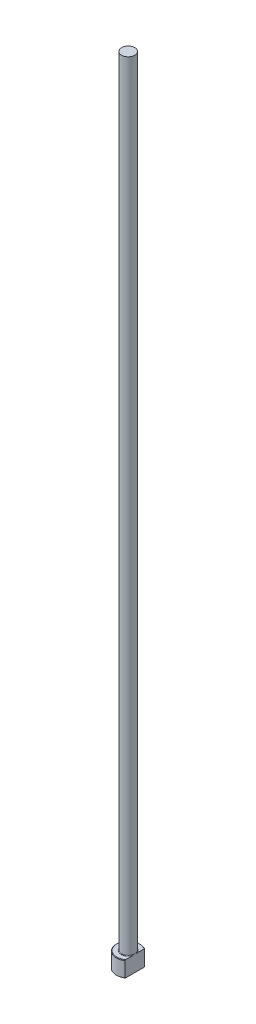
ISO-10303-21;
HEADER;
FILE_DESCRIPTION(('STEP AP214'),'2;1');
FILE_NAME('part.step','',(''),(''),'','','');
FILE_SCHEMA(('AUTOMOTIVE_DESIGN { 1 0 10303 214 1 1 1 1 }'));
ENDSEC;
DATA;
#1=APPLICATION_CONTEXT('core data for automotive mechanical design processes');
#2=APPLICATION_PROTOCOL_DEFINITION('international standard','automotive_design',2000,#1);
#3=PRODUCT_CONTEXT('',#1,'mechanical');
#4=PRODUCT('Part','Part','',(#3));
#5=PRODUCT_RELATED_PRODUCT_CATEGORY('part','',(#4));
#6=PRODUCT_DEFINITION_FORMATION('','',#4);
#7=PRODUCT_DEFINITION_CONTEXT('part definition',#1,'design');
#8=PRODUCT_DEFINITION('design','',#6,#7);
#9=PRODUCT_DEFINITION_SHAPE('','',#8);
#10=(LENGTH_UNIT() NAMED_UNIT(*) SI_UNIT(.MILLI.,.METRE.));
#11=(NAMED_UNIT(*) PLANE_ANGLE_UNIT() SI_UNIT($,.RADIAN.));
#12=(NAMED_UNIT(*) SI_UNIT($,.STERADIAN.) SOLID_ANGLE_UNIT());
#13=UNCERTAINTY_MEASURE_WITH_UNIT(LENGTH_MEASURE(1.E-05),#10,'distance_accuracy_value','');
#14=(GEOMETRIC_REPRESENTATION_CONTEXT(3) GLOBAL_UNCERTAINTY_ASSIGNED_CONTEXT((#13)) GLOBAL_UNIT_ASSIGNED_CONTEXT((#10,
#11,#12)) REPRESENTATION_CONTEXT('',''));
#15=CARTESIAN_POINT('',(0.,0.,0.));
#16=DIRECTION('',(0.,0.,1.));
#17=DIRECTION('',(1.,0.,0.));
#18=AXIS2_PLACEMENT_3D('',#15,#16,#17);
#19=CARTESIAN_POINT('',(0.,0.,0.));
#20=DIRECTION('',(0.,-1.,0.));
#21=DIRECTION('',(0.,0.,-1.));
#22=AXIS2_PLACEMENT_3D('',#19,#20,#21);
#23=PLANE('',#22);
#24=CARTESIAN_POINT('',(0.,0.,0.));
#25=DIRECTION('',(0.,-1.,0.));
#26=DIRECTION('',(0.,0.,-1.));
#27=AXIS2_PLACEMENT_3D('',#24,#25,#26);
#28=CIRCLE('',#27,4.29999999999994);
#29=CARTESIAN_POINT('',(2.49999999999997,0.,3.49857113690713));
#30=VERTEX_POINT('',#29);
#31=CARTESIAN_POINT('',(2.49999999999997,0.,-3.49857113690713));
#32=VERTEX_POINT('',#31);
#33=EDGE_CURVE('E98',#30,#32,#28,.T.);
#34=ORIENTED_EDGE('',*,*,#33,.T.);
#35=DIRECTION('',(0.,0.,1.));
#36=VECTOR('',#35,1.);
#37=CARTESIAN_POINT('',(2.49999999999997,0.,3.74165738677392));
#38=LINE('',#37,#36);
#39=EDGE_CURVE('E83',#32,#30,#38,.T.);
#40=ORIENTED_EDGE('',*,*,#39,.T.);
#41=EDGE_LOOP('',(#34,#40));
#42=FACE_BOUND('',#41,.T.);
#43=ADVANCED_FACE('F32',(#42),#23,.T.);
#44=CARTESIAN_POINT('',(0.,259.958771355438,0.));
#45=DIRECTION('',(0.,1.,0.));
#46=DIRECTION('',(0.,0.,1.));
#47=AXIS2_PLACEMENT_3D('',#44,#45,#46);
#48=CYLINDRICAL_SURFACE('',#47,4.49999999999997);
#49=CARTESIAN_POINT('',(0.,5.80000000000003,0.));
#50=DIRECTION('',(0.,1.,0.));
#51=DIRECTION('',(0.,0.,1.));
#52=AXIS2_PLACEMENT_3D('',#49,#50,#51);
#53=CIRCLE('',#52,4.49999999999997);
#54=CARTESIAN_POINT('',(2.49999999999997,5.80000000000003,3.74165738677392));
#55=VERTEX_POINT('',#54);
#56=CARTESIAN_POINT('',(2.49999999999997,5.80000000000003,-3.74165738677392));
#57=VERTEX_POINT('',#56);
#58=EDGE_CURVE('E104',#55,#57,#53,.F.);
#59=ORIENTED_EDGE('',*,*,#58,.T.);
#60=DIRECTION('',(0.,-1.,0.));
#61=VECTOR('',#60,1.);
#62=CARTESIAN_POINT('',(2.49999999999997,300.,-3.74165738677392));
#63=LINE('',#62,#61);
#64=CARTESIAN_POINT('',(2.49999999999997,0.200000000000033,-3.74165738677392));
#65=VERTEX_POINT('',#64);
#66=EDGE_CURVE('E183',#57,#65,#63,.T.);
#67=ORIENTED_EDGE('',*,*,#66,.T.);
#68=CARTESIAN_POINT('',(0.,0.200000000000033,0.));
#69=DIRECTION('',(0.,-1.,0.));
#70=DIRECTION('',(0.,0.,-1.));
#71=AXIS2_PLACEMENT_3D('',#68,#69,#70);
#72=CIRCLE('',#71,4.49999999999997);
#73=CARTESIAN_POINT('',(2.49999999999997,0.200000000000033,3.74165738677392));
#74=VERTEX_POINT('',#73);
#75=EDGE_CURVE('E100',#65,#74,#72,.F.);
#76=ORIENTED_EDGE('',*,*,#75,.T.);
#77=DIRECTION('',(0.,-1.,0.));
#78=VECTOR('',#77,1.);
#79=CARTESIAN_POINT('',(2.49999999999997,300.,3.74165738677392));
#80=LINE('',#79,#78);
#81=EDGE_CURVE('E93',#55,#74,#80,.T.);
#82=ORIENTED_EDGE('',*,*,#81,.F.);
#83=EDGE_LOOP('',(#59,#67,#76,#82));
#84=FACE_BOUND('',#83,.T.);
#85=ADVANCED_FACE('F158',(#84),#48,.T.);
#86=CARTESIAN_POINT('',(-4.49999999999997,6.,0.));
#87=DIRECTION('',(0.,1.,0.));
#88=DIRECTION('',(0.,0.,1.));
#89=AXIS2_PLACEMENT_3D('',#86,#87,#88);
#90=PLANE('',#89);
#91=CARTESIAN_POINT('',(0.,6.,0.));
#92=DIRECTION('',(0.,1.,0.));
#93=DIRECTION('',(0.,0.,1.));
#94=AXIS2_PLACEMENT_3D('',#91,#92,#93);
#95=CIRCLE('',#94,4.29999999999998);
#96=CARTESIAN_POINT('',(2.49999999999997,6.,-3.49857113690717));
#97=VERTEX_POINT('',#96);
#98=CARTESIAN_POINT('',(2.49999999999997,6.,3.49857113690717));
#99=VERTEX_POINT('',#98);
#100=EDGE_CURVE('E178',#97,#99,#95,.T.);
#101=ORIENTED_EDGE('',*,*,#100,.T.);
#102=DIRECTION('',(0.,0.,-1.));
#103=VECTOR('',#102,1.);
#104=CARTESIAN_POINT('',(2.49999999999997,6.,0.));
#105=LINE('',#104,#103);
#106=CARTESIAN_POINT('',(2.49999999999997,5.99999999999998,1.01980390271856));
#107=VERTEX_POINT('',#106);
#108=EDGE_CURVE('E57',#99,#107,#105,.T.);
#109=ORIENTED_EDGE('',*,*,#108,.T.);
#110=CARTESIAN_POINT('',(0.,6.,0.));
#111=DIRECTION('',(0.,1.,0.));
#112=DIRECTION('',(0.,0.,1.));
#113=AXIS2_PLACEMENT_3D('',#110,#111,#112);
#114=CIRCLE('',#113,2.69999999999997);
#115=CARTESIAN_POINT('',(2.49999999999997,5.99999999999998,-1.01980390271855));
#116=VERTEX_POINT('',#115);
#117=EDGE_CURVE('E107',#107,#116,#114,.F.);
#118=ORIENTED_EDGE('',*,*,#117,.T.);
#119=EDGE_CURVE('E136',#116,#97,#105,.T.);
#120=ORIENTED_EDGE('',*,*,#119,.T.);
#121=EDGE_LOOP('',(#101,#109,#118,#120));
#122=FACE_BOUND('',#121,.T.);
#123=ADVANCED_FACE('F147',(#122),#90,.T.);
#124=CARTESIAN_POINT('',(0.,6.00000000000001,0.));
#125=DIRECTION('',(0.,-1.,0.));
#126=DIRECTION('',(0.,0.,-1.));
#127=AXIS2_PLACEMENT_3D('',#124,#125,#126);
#128=CONICAL_SURFACE('',#127,4.29999999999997,0.785398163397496);
#129=ORIENTED_EDGE('',*,*,#58,.F.);
#130=CARTESIAN_POINT('',(2.49999999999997,1.69536803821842,8.233449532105));
#131=CARTESIAN_POINT('',(2.49999999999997,1.84159559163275,8.08062583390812));
#132=CARTESIAN_POINT('',(2.49999999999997,1.98764793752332,7.92763429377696));
#133=CARTESIAN_POINT('',(2.49999999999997,2.27932845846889,7.62124541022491));
#134=CARTESIAN_POINT('',(2.49999999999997,2.42495663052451,7.46784806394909));
#135=CARTESIAN_POINT('',(2.49999999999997,2.86116481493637,7.0068675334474));
#136=CARTESIAN_POINT('',(2.49999999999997,3.15099433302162,6.69857321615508));
#137=CARTESIAN_POINT('',(2.49999999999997,3.72884985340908,6.07807253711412));
#138=CARTESIAN_POINT('',(2.49999999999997,4.01686464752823,5.76585569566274));
#139=CARTESIAN_POINT('',(2.49999999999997,4.44539957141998,5.29439081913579));
#140=CARTESIAN_POINT('',(2.49999999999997,4.58765535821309,5.1367216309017));
#141=CARTESIAN_POINT('',(2.49999999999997,4.87066186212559,4.8200396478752));
#142=CARTESIAN_POINT('',(2.49999999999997,5.011412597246,4.66102686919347));
#143=CARTESIAN_POINT('',(2.49999999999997,5.29570787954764,4.33582683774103));
#144=CARTESIAN_POINT('',(2.49999999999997,5.43918418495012,4.16957975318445));
#145=CARTESIAN_POINT('',(2.49999999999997,5.72327592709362,3.83461659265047));
#146=CARTESIAN_POINT('',(2.49999999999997,5.86389099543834,3.66590020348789));
#147=CARTESIAN_POINT('',(2.49999999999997,6.14107420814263,3.32513857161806));
#148=CARTESIAN_POINT('',(2.49999999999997,6.27764223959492,3.15309323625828));
#149=CARTESIAN_POINT('',(2.49999999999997,6.47795110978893,2.89156777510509));
#150=CARTESIAN_POINT('',(2.49999999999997,6.54395767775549,2.80382460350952));
#151=CARTESIAN_POINT('',(2.49999999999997,6.67408242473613,2.62695176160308));
#152=CARTESIAN_POINT('',(2.49999999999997,6.73820069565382,2.5378221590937));
#153=CARTESIAN_POINT('',(2.49999999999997,6.87152528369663,2.34725612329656));
#154=CARTESIAN_POINT('',(2.49999999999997,6.94043579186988,2.24561149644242));
#155=CARTESIAN_POINT('',(2.49999999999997,7.07436956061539,2.0398042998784));
#156=CARTESIAN_POINT('',(2.49999999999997,7.13939350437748,1.93564217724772));
#157=CARTESIAN_POINT('',(2.49999999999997,7.26425850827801,1.72423874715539));
#158=CARTESIAN_POINT('',(2.49999999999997,7.32410048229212,1.61699798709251));
#159=CARTESIAN_POINT('',(2.49999999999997,7.43673687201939,1.39892979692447));
#160=CARTESIAN_POINT('',(2.49999999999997,7.48953435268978,1.28810395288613));
#161=CARTESIAN_POINT('',(2.49999999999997,7.60157711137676,1.02468144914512));
#162=CARTESIAN_POINT('',(2.49999999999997,7.65714985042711,0.870425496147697));
#163=CARTESIAN_POINT('',(2.49999999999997,7.72191807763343,0.634205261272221));
#164=CARTESIAN_POINT('',(2.49999999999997,7.74039604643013,0.554773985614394));
#165=CARTESIAN_POINT('',(2.49999999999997,7.77027635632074,0.394570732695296));
#166=CARTESIAN_POINT('',(2.49999999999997,7.78167951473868,0.313798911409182));
#167=CARTESIAN_POINT('',(2.49999999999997,7.79679993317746,0.150603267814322));
#168=CARTESIAN_POINT('',(2.49999999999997,7.80042867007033,0.0681710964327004));
#169=CARTESIAN_POINT('',(2.49999999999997,7.79949026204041,-0.0966436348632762));
#170=CARTESIAN_POINT('',(2.49999999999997,7.79492331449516,-0.179026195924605));
#171=CARTESIAN_POINT('',(2.49999999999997,7.77788997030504,-0.343090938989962));
#172=CARTESIAN_POINT('',(2.49999999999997,7.76541077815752,-0.424771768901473));
#173=CARTESIAN_POINT('',(2.49999999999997,7.73330588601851,-0.586708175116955));
#174=CARTESIAN_POINT('',(2.49999999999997,7.71367845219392,-0.666963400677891));
#175=CARTESIAN_POINT('',(2.49999999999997,7.65833470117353,-0.860438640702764));
#176=CARTESIAN_POINT('',(2.49999999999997,7.61933642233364,-0.972715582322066));
#177=CARTESIAN_POINT('',(2.49999999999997,7.53162689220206,-1.19338710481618));
#178=CARTESIAN_POINT('',(2.49999999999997,7.48290892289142,-1.30177893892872));
#179=CARTESIAN_POINT('',(2.49999999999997,7.37798916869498,-1.51554087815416));
#180=CARTESIAN_POINT('',(2.49999999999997,7.32174953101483,-1.62089218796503));
#181=CARTESIAN_POINT('',(2.49999999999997,7.23334776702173,-1.77656150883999));
#182=CARTESIAN_POINT('',(2.49999999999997,7.20321149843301,-1.82805098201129));
#183=CARTESIAN_POINT('',(2.49999999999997,7.14176188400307,-1.93032073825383));
#184=CARTESIAN_POINT('',(2.49999999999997,7.11044858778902,-1.98110105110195));
#185=CARTESIAN_POINT('',(2.49999999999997,7.0042870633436,-2.14944611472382));
#186=CARTESIAN_POINT('',(2.49999999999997,6.92717470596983,-2.26558431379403));
#187=CARTESIAN_POINT('',(2.49999999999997,6.76891329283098,-2.49508800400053));
#188=CARTESIAN_POINT('',(2.49999999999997,6.68776326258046,-2.60845281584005));
#189=CARTESIAN_POINT('',(2.49999999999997,6.52238824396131,-2.83304153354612));
#190=CARTESIAN_POINT('',(2.49999999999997,6.43816097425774,-2.94426375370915));
#191=CARTESIAN_POINT('',(2.49999999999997,6.26739791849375,-3.16492607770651));
#192=CARTESIAN_POINT('',(2.49999999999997,6.18086198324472,-3.27436606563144));
#193=CARTESIAN_POINT('',(2.49999999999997,6.00577178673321,-3.49207549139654));
#194=CARTESIAN_POINT('',(2.49999999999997,5.91721294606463,-3.60034123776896));
#195=CARTESIAN_POINT('',(2.49999999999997,5.73865921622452,-3.81568349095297));
#196=CARTESIAN_POINT('',(2.49999999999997,5.64866429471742,-3.92275997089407));
#197=CARTESIAN_POINT('',(2.49999999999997,5.37704561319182,-4.24242567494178));
#198=CARTESIAN_POINT('',(2.49999999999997,5.19370393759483,-4.45355444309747));
#199=CARTESIAN_POINT('',(2.49999999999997,4.82367634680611,-4.87338717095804));
#200=CARTESIAN_POINT('',(2.49999999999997,4.63698598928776,-5.08208719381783));
#201=CARTESIAN_POINT('',(2.49999999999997,4.26138721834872,-5.49751911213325));
#202=CARTESIAN_POINT('',(2.49999999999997,4.07247857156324,-5.70425079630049));
#203=CARTESIAN_POINT('',(2.49999999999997,3.69329624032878,-6.11595801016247));
#204=CARTESIAN_POINT('',(2.49999999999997,3.50302465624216,-6.32093547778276));
#205=CARTESIAN_POINT('',(2.49999999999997,3.12126439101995,-6.72975403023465));
#206=CARTESIAN_POINT('',(2.49999999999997,2.92977570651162,-6.93359511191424));
#207=CARTESIAN_POINT('',(2.49999999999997,2.65119470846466,-7.2287714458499));
#208=CARTESIAN_POINT('',(2.49999999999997,2.56447790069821,-7.32046158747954));
#209=CARTESIAN_POINT('',(2.49999999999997,2.39085496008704,-7.50369470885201));
#210=CARTESIAN_POINT('',(2.49999999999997,2.30394879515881,-7.59523765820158));
#211=CARTESIAN_POINT('',(2.49999999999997,2.13016920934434,-7.77797738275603));
#212=CARTESIAN_POINT('',(2.49999999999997,2.04329612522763,-7.86917447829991));
#213=CARTESIAN_POINT('',(2.49999999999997,1.86942568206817,-8.0514176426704));
#214=CARTESIAN_POINT('',(2.49999999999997,1.78242834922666,-8.14246373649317));
#215=CARTESIAN_POINT('',(2.49999999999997,1.69536803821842,-8.233449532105));
#216=B_SPLINE_CURVE_WITH_KNOTS('',3,(#130,#131,#132,#133,#134,#135,#136,#137,#138,#139,#140,
#141,#142,#143,#144,#145,#146,#147,#148,#149,#150,#151,#152,#153,#154,#155,#156,#157,#158,#159,
#160,#161,#162,#163,#164,#165,#166,#167,#168,#169,#170,#171,#172,#173,#174,#175,#176,#177,#178,
#179,#180,#181,#182,#183,#184,#185,#186,#187,#188,#189,#190,#191,#192,#193,#194,#195,#196,#197,
#198,#199,#200,#201,#202,#203,#204,#205,#206,#207,#208,#209,#210,#211,#212,#213,#214,#215),
.UNSPECIFIED.,.F.,.F.,(4,2,2,2,2,2,2,2,2,2,2,2,2,2,2,2,2,2,2,2,2,2,2,2,2,2,2,2,2,2,2,2,2,2,2,2,
2,2,2,2,2,2,4),(0.,0.63453779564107,1.26908006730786,2.53848610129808,3.81276948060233,
4.44983884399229,5.08690057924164,5.74567154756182,6.40452680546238,7.06340042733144,
7.39277668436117,7.72213688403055,8.09047335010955,8.4587448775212,8.82695132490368,
9.19499704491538,9.68515232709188,9.92954493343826,10.1739093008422,10.4210416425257,
10.6681680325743,10.9156950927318,11.163282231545,11.5192140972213,11.8753928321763,
12.2334366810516,12.4124062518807,12.591368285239,13.0094573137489,13.427647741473,
13.8461547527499,14.2646888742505,14.6842890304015,15.1038986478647,15.9427186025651,
16.7827484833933,17.6228675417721,18.4618914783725,19.300917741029,19.6795229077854,
20.0581981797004,20.4360532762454,20.8138378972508),.UNSPECIFIED.);
#217=EDGE_CURVE('E135',#55,#99,#216,.T.);
#218=ORIENTED_EDGE('',*,*,#217,.T.);
#219=ORIENTED_EDGE('',*,*,#100,.F.);
#220=EDGE_CURVE('E127',#97,#57,#216,.T.);
#221=ORIENTED_EDGE('',*,*,#220,.T.);
#222=EDGE_LOOP('',(#129,#218,#219,#221));
#223=FACE_BOUND('',#222,.T.);
#224=ADVANCED_FACE('F143',(#223),#128,.T.);
#225=CARTESIAN_POINT('',(0.,0.200000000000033,0.));
#226=DIRECTION('',(0.,1.,0.));
#227=DIRECTION('',(0.,0.,1.));
#228=AXIS2_PLACEMENT_3D('',#225,#226,#227);
#229=CONICAL_SURFACE('',#228,4.49999999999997,0.785398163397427);
#230=ORIENTED_EDGE('',*,*,#75,.F.);
#231=CARTESIAN_POINT('',(2.49999999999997,4.30463196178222,-8.233449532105));
#232=CARTESIAN_POINT('',(2.49999999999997,4.15840440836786,-8.08062583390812));
#233=CARTESIAN_POINT('',(2.49999999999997,4.01235206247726,-7.92763429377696));
#234=CARTESIAN_POINT('',(2.49999999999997,3.72067154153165,-7.6212454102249));
#235=CARTESIAN_POINT('',(2.49999999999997,3.57504336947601,-7.46784806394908));
#236=CARTESIAN_POINT('',(2.49999999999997,3.13883518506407,-7.00686753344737));
#237=CARTESIAN_POINT('',(2.49999999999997,2.84900566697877,-6.69857321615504));
#238=CARTESIAN_POINT('',(2.49999999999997,2.27115014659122,-6.07807253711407));
#239=CARTESIAN_POINT('',(2.49999999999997,1.98313535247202,-5.76585569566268));
#240=CARTESIAN_POINT('',(2.49999999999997,1.55460042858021,-5.29439081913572));
#241=CARTESIAN_POINT('',(2.49999999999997,1.41234464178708,-5.13672163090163));
#242=CARTESIAN_POINT('',(2.49999999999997,1.12933813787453,-4.82003964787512));
#243=CARTESIAN_POINT('',(2.49999999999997,0.988587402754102,-4.66102686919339));
#244=CARTESIAN_POINT('',(2.49999999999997,0.70429212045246,-4.335826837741));
#245=CARTESIAN_POINT('',(2.49999999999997,0.560815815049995,-4.16957975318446));
#246=CARTESIAN_POINT('',(2.49999999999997,0.276724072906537,-3.83461659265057));
#247=CARTESIAN_POINT('',(2.49999999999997,0.136109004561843,-3.66590020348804));
#248=CARTESIAN_POINT('',(2.49999999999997,-0.141074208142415,-3.32513857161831));
#249=CARTESIAN_POINT('',(2.49999999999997,-0.277642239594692,-3.15309323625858));
#250=CARTESIAN_POINT('',(2.49999999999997,-0.47795110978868,-2.89156777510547));
#251=CARTESIAN_POINT('',(2.49999999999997,-0.543957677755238,-2.80382460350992));
#252=CARTESIAN_POINT('',(2.49999999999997,-0.674082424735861,-2.62695176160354));
#253=CARTESIAN_POINT('',(2.49999999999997,-0.73820069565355,-2.53782215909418));
#254=CARTESIAN_POINT('',(2.49999999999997,-0.871525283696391,-2.34725612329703));
#255=CARTESIAN_POINT('',(2.49999999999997,-0.94043579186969,-2.24561149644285));
#256=CARTESIAN_POINT('',(2.49999999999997,-1.07436956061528,-2.03980429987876));
#257=CARTESIAN_POINT('',(2.49999999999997,-1.13939350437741,-1.93564217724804));
#258=CARTESIAN_POINT('',(2.49999999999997,-1.26425850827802,-1.72423874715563));
#259=CARTESIAN_POINT('',(2.49999999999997,-1.32410048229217,-1.61699798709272));
#260=CARTESIAN_POINT('',(2.49999999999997,-1.4367368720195,-1.39892979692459));
#261=CARTESIAN_POINT('',(2.49999999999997,-1.48953435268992,-1.28810395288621));
#262=CARTESIAN_POINT('',(2.49999999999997,-1.60157711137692,-1.02468144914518));
#263=CARTESIAN_POINT('',(2.49999999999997,-1.65714985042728,-0.870425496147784));
#264=CARTESIAN_POINT('',(2.49999999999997,-1.72191807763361,-0.634205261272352));
#265=CARTESIAN_POINT('',(2.49999999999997,-1.74039604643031,-0.554773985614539));
#266=CARTESIAN_POINT('',(2.49999999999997,-1.77027635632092,-0.39457073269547));
#267=CARTESIAN_POINT('',(2.49999999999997,-1.78167951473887,-0.313798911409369));
#268=CARTESIAN_POINT('',(2.49999999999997,-1.79679993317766,-0.150603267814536));
#269=CARTESIAN_POINT('',(2.49999999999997,-1.80042867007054,-0.0681710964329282));
#270=CARTESIAN_POINT('',(2.49999999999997,-1.79949026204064,0.0966436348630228));
#271=CARTESIAN_POINT('',(2.49999999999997,-1.79492331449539,0.179026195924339));
#272=CARTESIAN_POINT('',(2.49999999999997,-1.7778899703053,0.343090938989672));
#273=CARTESIAN_POINT('',(2.49999999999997,-1.76541077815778,0.424771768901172));
#274=CARTESIAN_POINT('',(2.49999999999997,-1.73330588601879,0.586708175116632));
#275=CARTESIAN_POINT('',(2.49999999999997,-1.71367845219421,0.666963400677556));
#276=CARTESIAN_POINT('',(2.49999999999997,-1.65833470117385,0.860438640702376));
#277=CARTESIAN_POINT('',(2.49999999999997,-1.61933642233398,0.972715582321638));
#278=CARTESIAN_POINT('',(2.49999999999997,-1.53162689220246,1.19338710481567));
#279=CARTESIAN_POINT('',(2.49999999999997,-1.48290892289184,1.30177893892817));
#280=CARTESIAN_POINT('',(2.49999999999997,-1.37798916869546,1.51554087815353));
#281=CARTESIAN_POINT('',(2.49999999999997,-1.32174953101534,1.62089218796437));
#282=CARTESIAN_POINT('',(2.49999999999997,-1.23334776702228,1.77656150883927));
#283=CARTESIAN_POINT('',(2.49999999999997,-1.20321149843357,1.82805098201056));
#284=CARTESIAN_POINT('',(2.49999999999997,-1.14176188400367,1.93032073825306));
#285=CARTESIAN_POINT('',(2.49999999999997,-1.11044858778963,1.98110105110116));
#286=CARTESIAN_POINT('',(2.49999999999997,-1.00428706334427,2.14944611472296));
#287=CARTESIAN_POINT('',(2.49999999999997,-0.927174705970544,2.26558431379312));
#288=CARTESIAN_POINT('',(2.49999999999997,-0.768913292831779,2.49508800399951));
#289=CARTESIAN_POINT('',(2.49999999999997,-0.687763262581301,2.60845281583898));
#290=CARTESIAN_POINT('',(2.49999999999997,-0.522388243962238,2.83304153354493));
#291=CARTESIAN_POINT('',(2.49999999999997,-0.438160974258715,2.94426375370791));
#292=CARTESIAN_POINT('',(2.49999999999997,-0.267397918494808,3.16492607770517));
#293=CARTESIAN_POINT('',(2.49999999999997,-0.180861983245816,3.27436606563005));
#294=CARTESIAN_POINT('',(2.49999999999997,-0.00577178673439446,3.49207549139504));
#295=CARTESIAN_POINT('',(2.49999999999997,0.0827870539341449,3.60034123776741));
#296=CARTESIAN_POINT('',(2.49999999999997,0.261340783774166,3.81568349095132));
#297=CARTESIAN_POINT('',(2.49999999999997,0.351335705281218,3.92275997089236));
#298=CARTESIAN_POINT('',(2.49999999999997,0.622954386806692,4.24242567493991));
#299=CARTESIAN_POINT('',(2.49999999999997,0.806296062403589,4.45355444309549));
#300=CARTESIAN_POINT('',(2.49999999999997,1.17632365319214,4.87338717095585));
#301=CARTESIAN_POINT('',(2.49999999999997,1.3630140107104,5.08208719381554));
#302=CARTESIAN_POINT('',(2.49999999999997,1.73861278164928,5.49751911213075));
#303=CARTESIAN_POINT('',(2.49999999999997,1.92752142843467,5.70425079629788));
#304=CARTESIAN_POINT('',(2.49999999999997,2.30670375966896,6.11595801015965));
#305=CARTESIAN_POINT('',(2.49999999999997,2.49697534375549,6.32093547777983));
#306=CARTESIAN_POINT('',(2.49999999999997,2.87873560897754,6.72975403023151));
#307=CARTESIAN_POINT('',(2.49999999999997,3.07022429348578,6.93359511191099));
#308=CARTESIAN_POINT('',(2.49999999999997,3.34880529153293,7.22877144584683));
#309=CARTESIAN_POINT('',(2.49999999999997,3.43552209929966,7.32046158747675));
#310=CARTESIAN_POINT('',(2.49999999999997,3.60914503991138,7.50369470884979));
#311=CARTESIAN_POINT('',(2.49999999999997,3.69605120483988,7.59523765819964));
#312=CARTESIAN_POINT('',(2.49999999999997,3.8698307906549,7.77797738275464));
#313=CARTESIAN_POINT('',(2.49999999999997,3.9567038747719,7.8691744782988));
#314=CARTESIAN_POINT('',(2.49999999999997,4.13057431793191,8.05141764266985));
#315=CARTESIAN_POINT('',(2.49999999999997,4.2175716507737,8.14246373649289));
#316=CARTESIAN_POINT('',(2.49999999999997,4.30463196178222,8.233449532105));
#317=B_SPLINE_CURVE_WITH_KNOTS('',3,(#231,#232,#233,#234,#235,#236,#237,#238,#239,#240,#241,
#242,#243,#244,#245,#246,#247,#248,#249,#250,#251,#252,#253,#254,#255,#256,#257,#258,#259,#260,
#261,#262,#263,#264,#265,#266,#267,#268,#269,#270,#271,#272,#273,#274,#275,#276,#277,#278,#279,
#280,#281,#282,#283,#284,#285,#286,#287,#288,#289,#290,#291,#292,#293,#294,#295,#296,#297,#298,
#299,#300,#301,#302,#303,#304,#305,#306,#307,#308,#309,#310,#311,#312,#313,#314,#315,#316),
.UNSPECIFIED.,.F.,.F.,(4,2,2,2,2,2,2,2,2,2,2,2,2,2,2,2,2,2,2,2,2,2,2,2,2,2,2,2,2,2,2,2,2,2,2,2,
2,2,2,2,2,2,4),(0.,0.634537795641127,1.26908006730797,2.53848610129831,3.81276948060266,
4.44983884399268,5.08690057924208,5.74567154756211,6.40452680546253,7.06340042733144,
7.3927766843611,7.72213688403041,8.09047335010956,8.45874487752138,8.82695132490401,
9.19499704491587,9.6851523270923,9.92954493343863,10.1739093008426,10.421041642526,
10.6681680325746,10.915695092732,11.1632822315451,11.5192140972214,11.8753928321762,
12.2334366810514,12.4124062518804,12.5913682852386,13.0094573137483,13.4276477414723,
13.8461547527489,14.2646888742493,14.6842890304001,15.1038986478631,15.942718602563,
16.7827484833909,17.6228675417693,18.4618914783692,19.3009177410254,19.679522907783,
20.0581981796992,20.4360532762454,20.8138378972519),.UNSPECIFIED.);
#318=EDGE_CURVE('E86',#65,#32,#317,.T.);
#319=ORIENTED_EDGE('',*,*,#318,.T.);
#320=ORIENTED_EDGE('',*,*,#33,.F.);
#321=EDGE_CURVE('E89',#30,#74,#317,.T.);
#322=ORIENTED_EDGE('',*,*,#321,.T.);
#323=EDGE_LOOP('',(#230,#319,#320,#322));
#324=FACE_BOUND('',#323,.T.);
#325=ADVANCED_FACE('F97',(#324),#229,.T.);
#326=CARTESIAN_POINT('',(0.,6.19999999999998,0.));
#327=DIRECTION('',(0.,1.,0.));
#328=DIRECTION('',(0.,0.,1.));
#329=AXIS2_PLACEMENT_3D('',#326,#327,#328);
#330=TOROIDAL_SURFACE('',#329,2.69999999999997,0.2);
#331=CARTESIAN_POINT('',(2.49999999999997,6.19999999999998,0.));
#332=CARTESIAN_POINT('',(2.49999999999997,6.20000050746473,5.2906045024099E-11));
#333=CARTESIAN_POINT('',(2.49999999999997,6.20000101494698,-1.70517168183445E-07));
#334=CARTESIAN_POINT('',(2.49999999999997,6.20000196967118,-6.5944382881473E-07));
#335=CARTESIAN_POINT('',(2.49999999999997,6.20000240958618,-9.87883952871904E-07));
#336=CARTESIAN_POINT('',(2.49999999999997,6.20000331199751,-1.77246896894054E-06));
#337=CARTESIAN_POINT('',(2.49999999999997,6.20000376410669,-2.24097233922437E-06));
#338=CARTESIAN_POINT('',(2.49999999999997,6.20000458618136,-3.2218606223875E-06));
#339=CARTESIAN_POINT('',(2.49999999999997,6.2000049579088,-3.73286591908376E-06));
#340=CARTESIAN_POINT('',(2.49999999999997,6.20000630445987,-5.67453790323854E-06));
#341=CARTESIAN_POINT('',(2.49999999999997,6.20000720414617,-7.15943636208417E-06));
#342=CARTESIAN_POINT('',(2.49999999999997,6.20000871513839,-1.0130438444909E-05));
#343=CARTESIAN_POINT('',(2.49999999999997,6.20000934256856,-1.16087239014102E-05));
#344=CARTESIAN_POINT('',(2.49999999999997,6.20001191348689,-1.77555557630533E-05));
#345=CARTESIAN_POINT('',(2.49999999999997,6.20001378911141,-2.24564508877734E-05));
#346=CARTESIAN_POINT('',(2.49999999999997,6.2000166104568,-3.14167105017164E-05));
#347=CARTESIAN_POINT('',(2.49999999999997,6.20001764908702,-3.56468505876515E-05));
#348=CARTESIAN_POINT('',(2.49999999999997,6.20002511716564,-6.67543466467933E-05));
#349=CARTESIAN_POINT('',(2.49999999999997,6.20003067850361,-9.37930231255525E-05));
#350=CARTESIAN_POINT('',(2.49999999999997,6.20005501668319,-0.000200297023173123));
#351=CARTESIAN_POINT('',(2.49999999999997,6.20007833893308,-0.00027869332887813));
#352=CARTESIAN_POINT('',(2.49999999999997,6.20016883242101,-0.000588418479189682));
#353=CARTESIAN_POINT('',(2.49999999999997,6.20023298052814,-0.000820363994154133));
#354=CARTESIAN_POINT('',(2.49999999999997,6.20048923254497,-0.00173961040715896));
#355=CARTESIAN_POINT('',(2.49999999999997,6.20068508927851,-0.0024261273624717));
#356=CARTESIAN_POINT('',(2.49999999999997,6.20149752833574,-0.00528196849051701));
#357=CARTESIAN_POINT('',(2.49999999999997,6.20210941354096,-0.00745227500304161));
#358=CARTESIAN_POINT('',(2.49999999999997,6.20774599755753,-0.0274346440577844));
#359=CARTESIAN_POINT('',(2.49999999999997,6.21279017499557,-0.0452427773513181));
#360=CARTESIAN_POINT('',(2.49999999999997,6.22264347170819,-0.0801677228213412));
#361=CARTESIAN_POINT('',(2.49999999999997,6.22745402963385,-0.0972841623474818));
#362=CARTESIAN_POINT('',(2.49999999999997,6.2376348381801,-0.133672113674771));
#363=CARTESIAN_POINT('',(2.49999999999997,6.24299975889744,-0.152945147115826));
#364=CARTESIAN_POINT('',(2.49999999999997,6.25370389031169,-0.191722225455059));
#365=CARTESIAN_POINT('',(2.49999999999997,6.25904219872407,-0.211226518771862));
#366=CARTESIAN_POINT('',(2.49999999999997,6.27184445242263,-0.258540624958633));
#367=CARTESIAN_POINT('',(2.49999999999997,6.27925018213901,-0.286366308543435));
#368=CARTESIAN_POINT('',(2.49999999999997,6.2935514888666,-0.341371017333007));
#369=CARTESIAN_POINT('',(2.49999999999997,6.30045534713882,-0.368547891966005));
#370=CARTESIAN_POINT('',(2.49999999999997,6.3199112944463,-0.447507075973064));
#371=CARTESIAN_POINT('',(2.49999999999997,6.33195369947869,-0.499417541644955));
#372=CARTESIAN_POINT('',(2.49999999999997,6.35404241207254,-0.60418810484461));
#373=CARTESIAN_POINT('',(2.49999999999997,6.36406867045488,-0.657052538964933));
#374=CARTESIAN_POINT('',(2.49999999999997,6.38176575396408,-0.767598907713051));
#375=CARTESIAN_POINT('',(2.49999999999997,6.38917909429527,-0.825323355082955));
#376=CARTESIAN_POINT('',(2.49999999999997,6.39884096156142,-0.941055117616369));
#377=CARTESIAN_POINT('',(2.49999999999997,6.40111055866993,-0.999060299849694));
#378=CARTESIAN_POINT('',(2.49999999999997,6.39847691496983,-1.09324578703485));
#379=CARTESIAN_POINT('',(2.49999999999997,6.39593644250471,-1.12948454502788));
#380=CARTESIAN_POINT('',(2.49999999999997,6.38674319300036,-1.20096926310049));
#381=CARTESIAN_POINT('',(2.49999999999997,6.38015410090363,-1.23622192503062));
#382=CARTESIAN_POINT('',(2.49999999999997,6.36639936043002,-1.28579148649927));
#383=CARTESIAN_POINT('',(2.49999999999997,6.36162670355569,-1.30076836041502));
#384=CARTESIAN_POINT('',(2.49999999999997,6.35062798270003,-1.33028325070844));
#385=CARTESIAN_POINT('',(2.49999999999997,6.34439458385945,-1.34481861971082));
#386=CARTESIAN_POINT('',(2.49999999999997,6.33003808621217,-1.37319413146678));
#387=CARTESIAN_POINT('',(2.49999999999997,6.32189015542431,-1.38702194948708));
#388=CARTESIAN_POINT('',(2.49999999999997,6.30325367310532,-1.41298115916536));
#389=CARTESIAN_POINT('',(2.49999999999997,6.29278241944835,-1.42512406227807));
#390=CARTESIAN_POINT('',(2.49999999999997,6.27569207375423,-1.44029611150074));
#391=CARTESIAN_POINT('',(2.49999999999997,6.27021837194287,-1.44461019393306));
#392=CARTESIAN_POINT('',(2.49999999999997,6.25870897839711,-1.45242709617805));
#393=CARTESIAN_POINT('',(2.49999999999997,6.25267333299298,-1.45592998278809));
#394=CARTESIAN_POINT('',(2.49999999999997,6.24001938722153,-1.46191450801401));
#395=CARTESIAN_POINT('',(2.49999999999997,6.23339520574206,-1.46438399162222));
#396=CARTESIAN_POINT('',(2.49999999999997,6.2197934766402,-1.46798853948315));
#397=CARTESIAN_POINT('',(2.49999999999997,6.21281651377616,-1.46912574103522));
#398=CARTESIAN_POINT('',(2.49999999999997,6.19961348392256,-1.46988240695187));
#399=CARTESIAN_POINT('',(2.49999999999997,6.19339654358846,-1.46966594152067));
#400=CARTESIAN_POINT('',(2.49999999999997,6.18110362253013,-1.46811597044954));
#401=CARTESIAN_POINT('',(2.49999999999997,6.17502769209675,-1.46678207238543));
#402=CARTESIAN_POINT('',(2.49999999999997,6.16354702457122,-1.46323301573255));
#403=CARTESIAN_POINT('',(2.49999999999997,6.15812390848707,-1.46107586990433));
#404=CARTESIAN_POINT('',(2.49999999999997,6.14763458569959,-1.45603007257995));
#405=CARTESIAN_POINT('',(2.49999999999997,6.14256845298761,-1.45314127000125));
#406=CARTESIAN_POINT('',(2.49999999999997,6.12963191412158,-1.4446884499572));
#407=CARTESIAN_POINT('',(2.49999999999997,6.12209714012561,-1.43861122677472));
#408=CARTESIAN_POINT('',(2.49999999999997,6.10805350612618,-1.42536327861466));
#409=CARTESIAN_POINT('',(2.49999999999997,6.10154826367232,-1.41818886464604));
#410=CARTESIAN_POINT('',(2.49999999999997,6.08513615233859,-1.39772885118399));
#411=CARTESIAN_POINT('',(2.49999999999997,6.07611692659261,-1.38373739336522));
#412=CARTESIAN_POINT('',(2.49999999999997,6.06018433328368,-1.35465370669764));
#413=CARTESIAN_POINT('',(2.49999999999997,6.05327247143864,-1.33956070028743));
#414=CARTESIAN_POINT('',(2.49999999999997,6.04107204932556,-1.30868385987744));
#415=CARTESIAN_POINT('',(2.49999999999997,6.03578911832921,-1.29289784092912));
#416=CARTESIAN_POINT('',(2.49999999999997,6.02655583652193,-1.26093375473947));
#417=CARTESIAN_POINT('',(2.49999999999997,6.02260692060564,-1.24475528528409));
#418=CARTESIAN_POINT('',(2.49999999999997,6.01232854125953,-1.19551094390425));
#419=CARTESIAN_POINT('',(2.49999999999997,6.00769429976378,-1.16209442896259));
#420=CARTESIAN_POINT('',(2.49999999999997,6.00005311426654,-1.07761506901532));
#421=CARTESIAN_POINT('',(2.49999999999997,5.99913690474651,-1.02638928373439));
#422=CARTESIAN_POINT('',(2.49999999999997,6.00223345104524,-0.923947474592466));
#423=CARTESIAN_POINT('',(2.49999999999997,6.00626667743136,-0.872732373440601));
#424=CARTESIAN_POINT('',(2.49999999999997,6.0174995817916,-0.773934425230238));
#425=CARTESIAN_POINT('',(2.49999999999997,6.02448410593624,-0.726325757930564));
#426=CARTESIAN_POINT('',(2.49999999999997,6.04066526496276,-0.631906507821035));
#427=CARTESIAN_POINT('',(2.49999999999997,6.04984293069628,-0.585092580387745));
#428=CARTESIAN_POINT('',(2.49999999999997,6.06791405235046,-0.500780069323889));
#429=CARTESIAN_POINT('',(2.49999999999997,6.07652349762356,-0.463219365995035));
#430=CARTESIAN_POINT('',(2.49999999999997,6.09478102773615,-0.387318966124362));
#431=CARTESIAN_POINT('',(2.49999999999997,6.10445029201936,-0.348984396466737));
#432=CARTESIAN_POINT('',(2.49999999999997,6.12135487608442,-0.284095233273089));
#433=CARTESIAN_POINT('',(2.49999999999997,6.12843710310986,-0.257500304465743));
#434=CARTESIAN_POINT('',(2.49999999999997,6.14273562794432,-0.20465586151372));
#435=CARTESIAN_POINT('',(2.49999999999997,6.14994963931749,-0.178405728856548));
#436=CARTESIAN_POINT('',(2.49999999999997,6.16369218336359,-0.128877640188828));
#437=CARTESIAN_POINT('',(2.49999999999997,6.17020707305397,-0.105595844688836));
#438=CARTESIAN_POINT('',(2.49999999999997,6.1835809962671,-0.0580847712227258));
#439=CARTESIAN_POINT('',(2.49999999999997,6.19044308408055,-0.0338563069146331));
#440=CARTESIAN_POINT('',(2.49999999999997,6.19789108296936,-0.00745034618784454));
#441=CARTESIAN_POINT('',(2.49999999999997,6.19850354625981,-0.00527812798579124));
#442=CARTESIAN_POINT('',(2.49999999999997,6.19931612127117,-0.00242184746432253));
#443=CARTESIAN_POINT('',(2.49999999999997,6.19951155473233,-0.00173680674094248));
#444=CARTESIAN_POINT('',(2.49999999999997,6.19976729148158,-0.000819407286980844));
#445=CARTESIAN_POINT('',(2.49999999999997,6.19983133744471,-0.000587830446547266));
#446=CARTESIAN_POINT('',(2.49999999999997,6.19992170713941,-0.000278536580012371));
#447=CARTESIAN_POINT('',(2.49999999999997,6.19994501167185,-0.000200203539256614));
#448=CARTESIAN_POINT('',(2.49999999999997,6.19996933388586,-9.37727608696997E-05));
#449=CARTESIAN_POINT('',(2.49999999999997,6.19997489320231,-6.67431745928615E-05));
#450=CARTESIAN_POINT('',(2.49999999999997,6.19998235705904,-3.56449052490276E-05));
#451=CARTESIAN_POINT('',(2.49999999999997,6.19998339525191,-3.14152908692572E-05));
#452=CARTESIAN_POINT('',(2.49999999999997,6.19998621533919,-2.24560904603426E-05));
#453=CARTESIAN_POINT('',(2.49999999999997,6.19998809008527,-1.77557011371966E-05));
#454=CARTESIAN_POINT('',(2.49999999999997,6.19999065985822,-1.16093872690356E-05));
#455=CARTESIAN_POINT('',(2.49999999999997,6.19999128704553,-1.01311411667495E-05));
#456=CARTESIAN_POINT('',(2.49999999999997,6.19999279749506,-7.16017603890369E-06));
#457=CARTESIAN_POINT('',(2.49999999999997,6.19999369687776,-5.6752706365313E-06));
#458=CARTESIAN_POINT('',(2.49999999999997,6.19999504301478,-3.73354020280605E-06));
#459=CARTESIAN_POINT('',(2.49999999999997,6.19999541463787,-3.22250659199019E-06));
#460=CARTESIAN_POINT('',(2.49999999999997,6.19999623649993,-2.24154285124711E-06));
#461=CARTESIAN_POINT('',(2.49999999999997,6.19999668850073,-1.77299178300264E-06));
#462=CARTESIAN_POINT('',(2.49999999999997,6.19999759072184,-9.88293803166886E-07));
#463=CARTESIAN_POINT('',(2.49999999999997,6.19999803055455,-6.59792302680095E-07));
#464=CARTESIAN_POINT('',(2.49999999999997,6.19999898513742,-1.70712164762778E-07));
#465=CARTESIAN_POINT('',(2.49999999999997,6.19999949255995,-5.29034678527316E-11));
#466=CARTESIAN_POINT('',(2.49999999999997,6.19999999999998,0.));
#467=B_SPLINE_CURVE_WITH_KNOTS('',3,(#331,#332,#333,#334,#335,#336,#337,#338,#339,#340,#341,
#342,#343,#344,#345,#346,#347,#348,#349,#350,#351,#352,#353,#354,#355,#356,#357,#358,#359,#360,
#361,#362,#363,#364,#365,#366,#367,#368,#369,#370,#371,#372,#373,#374,#375,#376,#377,#378,#379,
#380,#381,#382,#383,#384,#385,#386,#387,#388,#389,#390,#391,#392,#393,#394,#395,#396,#397,#398,
#399,#400,#401,#402,#403,#404,#405,#406,#407,#408,#409,#410,#411,#412,#413,#414,#415,#416,#417,
#418,#419,#420,#421,#422,#423,#424,#425,#426,#427,#428,#429,#430,#431,#432,#433,#434,#435,#436,
#437,#438,#439,#440,#441,#442,#443,#444,#445,#446,#447,#448,#449,#450,#451,#452,#453,#454,#455,
#456,#457,#458,#459,#460,#461,#462,#463,#464,#465,#466),.UNSPECIFIED.,.T.,.F.,(4,2,2,2,2,2,2,2,
2,2,2,2,2,2,2,2,2,2,2,2,2,2,2,2,2,2,2,2,2,2,2,2,2,2,2,2,2,2,2,2,2,2,2,2,2,2,2,2,2,2,2,2,2,2,2,2,
2,2,2,2,2,2,2,2,2,2,2,4),(0.,1.53002974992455E-06,3.17429870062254E-06,5.11692883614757E-06,
7.01128899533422E-06,1.21993174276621E-05,1.70129960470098E-05,3.21659454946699E-05,
4.52166479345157E-05,0.000128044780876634,0.00037314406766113,0.00109538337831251,
0.00323676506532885,0.010001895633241,0.0655261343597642,0.118865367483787,0.178882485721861,
0.239547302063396,0.32592858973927,0.410047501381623,0.569885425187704,0.731241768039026,
0.905704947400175,1.07945217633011,1.18829443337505,1.29546693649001,1.34257193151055,
1.38991872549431,1.43791728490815,1.48556980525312,1.50642342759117,1.52727533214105,
1.54836603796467,1.56942286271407,1.58798129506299,1.60654624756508,1.62399133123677,
1.64144002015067,1.67031274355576,1.69928476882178,1.74894310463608,1.79863683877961,
1.8485004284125,1.89841748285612,1.99938099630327,2.15271136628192,2.30667804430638,
2.45095908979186,2.59403470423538,2.70962861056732,2.82822694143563,2.91079145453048,
2.99246070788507,3.06498967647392,3.14053132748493,3.14730244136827,3.14943921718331,
3.1501603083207,3.15040521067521,3.15048801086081,3.15050105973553,3.15051621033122,
3.15052102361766,3.15052621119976,3.15052810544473,3.15053004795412,3.150531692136,
3.15053322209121),.UNSPECIFIED.);
#468=CARTESIAN_POINT('',(2.49999999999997,6.19999999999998,0.));
#469=VERTEX_POINT('',#468);
#470=EDGE_CURVE('E11',#116,#469,#467,.T.);
#471=ORIENTED_EDGE('',*,*,#470,.F.);
#472=ORIENTED_EDGE('',*,*,#117,.F.);
#473=CARTESIAN_POINT('',(2.49999999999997,6.19999999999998,0.));
#474=CARTESIAN_POINT('',(2.49999999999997,6.19999949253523,-5.29059996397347E-11));
#475=CARTESIAN_POINT('',(2.49999999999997,6.19999898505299,1.70517168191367E-07));
#476=CARTESIAN_POINT('',(2.49999999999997,6.19999803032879,6.59443828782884E-07));
#477=CARTESIAN_POINT('',(2.49999999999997,6.19999759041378,9.8788395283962E-07));
#478=CARTESIAN_POINT('',(2.49999999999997,6.19999668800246,1.77246896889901E-06));
#479=CARTESIAN_POINT('',(2.49999999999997,6.19999623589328,2.24097233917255E-06));
#480=CARTESIAN_POINT('',(2.49999999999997,6.19999541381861,3.2218606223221E-06));
#481=CARTESIAN_POINT('',(2.49999999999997,6.19999504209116,3.73286591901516E-06));
#482=CARTESIAN_POINT('',(2.49999999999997,6.19999369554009,5.67453790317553E-06));
#483=CARTESIAN_POINT('',(2.49999999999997,6.1999927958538,7.15943636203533E-06));
#484=CARTESIAN_POINT('',(2.49999999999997,6.19999128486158,1.01304384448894E-05));
#485=CARTESIAN_POINT('',(2.49999999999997,6.19999065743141,1.16087239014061E-05));
#486=CARTESIAN_POINT('',(2.49999999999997,6.19998808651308,1.77555557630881E-05));
#487=CARTESIAN_POINT('',(2.49999999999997,6.19998621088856,2.24564508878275E-05));
#488=CARTESIAN_POINT('',(2.49999999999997,6.19998338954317,3.14167105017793E-05));
#489=CARTESIAN_POINT('',(2.49999999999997,6.19998235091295,3.5646850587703E-05));
#490=CARTESIAN_POINT('',(2.49999999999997,6.19997488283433,6.67543466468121E-05));
#491=CARTESIAN_POINT('',(2.49999999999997,6.19996932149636,9.37930231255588E-05));
#492=CARTESIAN_POINT('',(2.49999999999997,6.19994498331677,0.000200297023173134));
#493=CARTESIAN_POINT('',(2.49999999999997,6.19992166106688,0.000278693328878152));
#494=CARTESIAN_POINT('',(2.49999999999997,6.19983116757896,0.000588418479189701));
#495=CARTESIAN_POINT('',(2.49999999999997,6.19976701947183,0.000820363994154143));
#496=CARTESIAN_POINT('',(2.49999999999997,6.19951076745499,0.00173961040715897));
#497=CARTESIAN_POINT('',(2.49999999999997,6.19931491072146,0.0024261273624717));
#498=CARTESIAN_POINT('',(2.49999999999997,6.19850247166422,0.00528196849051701));
#499=CARTESIAN_POINT('',(2.49999999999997,6.197890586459,0.00745227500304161));
#500=CARTESIAN_POINT('',(2.49999999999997,6.19225400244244,0.0274346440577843));
#501=CARTESIAN_POINT('',(2.49999999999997,6.1872098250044,0.045242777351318));
#502=CARTESIAN_POINT('',(2.49999999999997,6.17735652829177,0.0801677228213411));
#503=CARTESIAN_POINT('',(2.49999999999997,6.17254597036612,0.0972841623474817));
#504=CARTESIAN_POINT('',(2.49999999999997,6.16236516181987,0.133672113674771));
#505=CARTESIAN_POINT('',(2.49999999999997,6.15700024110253,0.152945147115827));
#506=CARTESIAN_POINT('',(2.49999999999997,6.14629610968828,0.19172222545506));
#507=CARTESIAN_POINT('',(2.49999999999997,6.1409578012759,0.211226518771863));
#508=CARTESIAN_POINT('',(2.49999999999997,6.12815554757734,0.258540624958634));
#509=CARTESIAN_POINT('',(2.49999999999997,6.12074981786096,0.286366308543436));
#510=CARTESIAN_POINT('',(2.49999999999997,6.10644851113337,0.341371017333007));
#511=CARTESIAN_POINT('',(2.49999999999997,6.09954465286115,0.368547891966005));
#512=CARTESIAN_POINT('',(2.49999999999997,6.08008870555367,0.447507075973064));
#513=CARTESIAN_POINT('',(2.49999999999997,6.06804630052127,0.499417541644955));
#514=CARTESIAN_POINT('',(2.49999999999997,6.04595758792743,0.60418810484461));
#515=CARTESIAN_POINT('',(2.49999999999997,6.03593132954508,0.657052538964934));
#516=CARTESIAN_POINT('',(2.49999999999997,6.01823424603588,0.767598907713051));
#517=CARTESIAN_POINT('',(2.49999999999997,6.0108209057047,0.825323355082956));
#518=CARTESIAN_POINT('',(2.49999999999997,6.00115903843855,0.941055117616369));
#519=CARTESIAN_POINT('',(2.49999999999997,5.99888944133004,0.999060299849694));
#520=CARTESIAN_POINT('',(2.49999999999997,6.00152308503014,1.09324578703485));
#521=CARTESIAN_POINT('',(2.49999999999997,6.00406355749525,1.12948454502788));
#522=CARTESIAN_POINT('',(2.49999999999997,6.0132568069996,1.20096926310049));
#523=CARTESIAN_POINT('',(2.49999999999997,6.01984589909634,1.23622192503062));
#524=CARTESIAN_POINT('',(2.49999999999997,6.03360063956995,1.28579148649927));
#525=CARTESIAN_POINT('',(2.49999999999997,6.03837329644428,1.30076836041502));
#526=CARTESIAN_POINT('',(2.49999999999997,6.04937201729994,1.33028325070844));
#527=CARTESIAN_POINT('',(2.49999999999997,6.05560541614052,1.34481861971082));
#528=CARTESIAN_POINT('',(2.49999999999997,6.0699619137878,1.37319413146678));
#529=CARTESIAN_POINT('',(2.49999999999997,6.07810984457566,1.38702194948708));
#530=CARTESIAN_POINT('',(2.49999999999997,6.09674632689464,1.41298115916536));
#531=CARTESIAN_POINT('',(2.49999999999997,6.10721758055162,1.42512406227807));
#532=CARTESIAN_POINT('',(2.49999999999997,6.12430792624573,1.44029611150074));
#533=CARTESIAN_POINT('',(2.49999999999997,6.12978162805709,1.44461019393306));
#534=CARTESIAN_POINT('',(2.49999999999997,6.14129102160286,1.45242709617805));
#535=CARTESIAN_POINT('',(2.49999999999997,6.14732666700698,1.45592998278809));
#536=CARTESIAN_POINT('',(2.49999999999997,6.15998061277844,1.46191450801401));
#537=CARTESIAN_POINT('',(2.49999999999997,6.16660479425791,1.46438399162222));
#538=CARTESIAN_POINT('',(2.49999999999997,6.18020652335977,1.46798853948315));
#539=CARTESIAN_POINT('',(2.49999999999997,6.18718348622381,1.46912574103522));
#540=CARTESIAN_POINT('',(2.49999999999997,6.20038651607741,1.46988240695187));
#541=CARTESIAN_POINT('',(2.49999999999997,6.2066034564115,1.46966594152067));
#542=CARTESIAN_POINT('',(2.49999999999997,6.21889637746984,1.46811597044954));
#543=CARTESIAN_POINT('',(2.49999999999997,6.22497230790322,1.46678207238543));
#544=CARTESIAN_POINT('',(2.49999999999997,6.23645297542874,1.46323301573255));
#545=CARTESIAN_POINT('',(2.49999999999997,6.24187609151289,1.46107586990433));
#546=CARTESIAN_POINT('',(2.49999999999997,6.25236541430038,1.45603007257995));
#547=CARTESIAN_POINT('',(2.49999999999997,6.25743154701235,1.45314127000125));
#548=CARTESIAN_POINT('',(2.49999999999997,6.27036808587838,1.4446884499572));
#549=CARTESIAN_POINT('',(2.49999999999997,6.27790285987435,1.43861122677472));
#550=CARTESIAN_POINT('',(2.49999999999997,6.29194649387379,1.42536327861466));
#551=CARTESIAN_POINT('',(2.49999999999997,6.29845173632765,1.41818886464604));
#552=CARTESIAN_POINT('',(2.49999999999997,6.31486384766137,1.39772885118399));
#553=CARTESIAN_POINT('',(2.49999999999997,6.32388307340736,1.38373739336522));
#554=CARTESIAN_POINT('',(2.49999999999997,6.33981566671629,1.35465370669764));
#555=CARTESIAN_POINT('',(2.49999999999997,6.34672752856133,1.33956070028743));
#556=CARTESIAN_POINT('',(2.49999999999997,6.3589279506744,1.30868385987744));
#557=CARTESIAN_POINT('',(2.49999999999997,6.36421088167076,1.29289784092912));
#558=CARTESIAN_POINT('',(2.49999999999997,6.37344416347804,1.26093375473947));
#559=CARTESIAN_POINT('',(2.49999999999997,6.37739307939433,1.24475528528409));
#560=CARTESIAN_POINT('',(2.49999999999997,6.38767145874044,1.19551094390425));
#561=CARTESIAN_POINT('',(2.49999999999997,6.39230570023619,1.16209442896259));
#562=CARTESIAN_POINT('',(2.49999999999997,6.39994688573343,1.07761506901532));
#563=CARTESIAN_POINT('',(2.49999999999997,6.40086309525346,1.02638928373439));
#564=CARTESIAN_POINT('',(2.49999999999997,6.39776654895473,0.923947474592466));
#565=CARTESIAN_POINT('',(2.49999999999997,6.39373332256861,0.872732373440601));
#566=CARTESIAN_POINT('',(2.49999999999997,6.38250041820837,0.773934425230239));
#567=CARTESIAN_POINT('',(2.49999999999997,6.37551589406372,0.726325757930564));
#568=CARTESIAN_POINT('',(2.49999999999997,6.3593347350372,0.631906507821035));
#569=CARTESIAN_POINT('',(2.49999999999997,6.35015706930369,0.585092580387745));
#570=CARTESIAN_POINT('',(2.49999999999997,6.33208594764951,0.50078006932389));
#571=CARTESIAN_POINT('',(2.49999999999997,6.32347650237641,0.463219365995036));
#572=CARTESIAN_POINT('',(2.49999999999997,6.30521897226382,0.387318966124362));
#573=CARTESIAN_POINT('',(2.49999999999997,6.29554970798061,0.348984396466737));
#574=CARTESIAN_POINT('',(2.49999999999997,6.27864512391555,0.284095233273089));
#575=CARTESIAN_POINT('',(2.49999999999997,6.27156289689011,0.257500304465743));
#576=CARTESIAN_POINT('',(2.49999999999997,6.25726437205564,0.204655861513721));
#577=CARTESIAN_POINT('',(2.49999999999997,6.25005036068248,0.17840572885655));
#578=CARTESIAN_POINT('',(2.49999999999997,6.23630781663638,0.128877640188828));
#579=CARTESIAN_POINT('',(2.49999999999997,6.22979292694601,0.105595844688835));
#580=CARTESIAN_POINT('',(2.49999999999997,6.21641900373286,0.0580847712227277));
#581=CARTESIAN_POINT('',(2.49999999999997,6.20955691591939,0.0338563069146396));
#582=CARTESIAN_POINT('',(2.49999999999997,6.2021089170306,0.00745034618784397));
#583=CARTESIAN_POINT('',(2.49999999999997,6.20149645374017,0.00527812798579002));
#584=CARTESIAN_POINT('',(2.49999999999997,6.20068387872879,0.00242184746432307));
#585=CARTESIAN_POINT('',(2.49999999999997,6.20048844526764,0.00173680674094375));
#586=CARTESIAN_POINT('',(2.49999999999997,6.20023270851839,0.000819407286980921));
#587=CARTESIAN_POINT('',(2.49999999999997,6.20016866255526,0.000587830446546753));
#588=CARTESIAN_POINT('',(2.49999999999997,6.20007829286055,0.000278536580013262));
#589=CARTESIAN_POINT('',(2.49999999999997,6.20005498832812,0.000200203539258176));
#590=CARTESIAN_POINT('',(2.49999999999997,6.20003066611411,9.37727608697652E-05));
#591=CARTESIAN_POINT('',(2.49999999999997,6.20002510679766,6.67431745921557E-05));
#592=CARTESIAN_POINT('',(2.49999999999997,6.20001764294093,3.56449052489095E-05));
#593=CARTESIAN_POINT('',(2.49999999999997,6.20001660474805,3.14152908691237E-05));
#594=CARTESIAN_POINT('',(2.49999999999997,6.20001378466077,2.24560904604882E-05));
#595=CARTESIAN_POINT('',(2.49999999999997,6.20001190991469,1.77557011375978E-05));
#596=CARTESIAN_POINT('',(2.49999999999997,6.20000934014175,1.16093872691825E-05));
#597=CARTESIAN_POINT('',(2.49999999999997,6.20000871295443,1.01311411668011E-05));
#598=CARTESIAN_POINT('',(2.49999999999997,6.20000720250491,7.16017603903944E-06));
#599=CARTESIAN_POINT('',(2.49999999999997,6.20000630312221,5.67527063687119E-06));
#600=CARTESIAN_POINT('',(2.49999999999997,6.20000495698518,3.73354020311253E-06));
#601=CARTESIAN_POINT('',(2.49999999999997,6.2000045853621,3.22250659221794E-06));
#602=CARTESIAN_POINT('',(2.49999999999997,6.20000376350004,2.2415428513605E-06));
#603=CARTESIAN_POINT('',(2.49999999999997,6.20000331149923,1.77299178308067E-06));
#604=CARTESIAN_POINT('',(2.49999999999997,6.20000240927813,9.88293803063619E-07));
#605=CARTESIAN_POINT('',(2.49999999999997,6.20000196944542,6.59792302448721E-07));
#606=CARTESIAN_POINT('',(2.49999999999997,6.20000101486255,1.70712164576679E-07));
#607=CARTESIAN_POINT('',(2.49999999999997,6.20000050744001,5.29034224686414E-11));
#608=CARTESIAN_POINT('',(2.49999999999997,6.19999999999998,0.));
#609=B_SPLINE_CURVE_WITH_KNOTS('',3,(#473,#474,#475,#476,#477,#478,#479,#480,#481,#482,#483,
#484,#485,#486,#487,#488,#489,#490,#491,#492,#493,#494,#495,#496,#497,#498,#499,#500,#501,#502,
#503,#504,#505,#506,#507,#508,#509,#510,#511,#512,#513,#514,#515,#516,#517,#518,#519,#520,#521,
#522,#523,#524,#525,#526,#527,#528,#529,#530,#531,#532,#533,#534,#535,#536,#537,#538,#539,#540,
#541,#542,#543,#544,#545,#546,#547,#548,#549,#550,#551,#552,#553,#554,#555,#556,#557,#558,#559,
#560,#561,#562,#563,#564,#565,#566,#567,#568,#569,#570,#571,#572,#573,#574,#575,#576,#577,#578,
#579,#580,#581,#582,#583,#584,#585,#586,#587,#588,#589,#590,#591,#592,#593,#594,#595,#596,#597,
#598,#599,#600,#601,#602,#603,#604,#605,#606,#607,#608),.UNSPECIFIED.,.T.,.F.,(4,2,2,2,2,2,2,2,
2,2,2,2,2,2,2,2,2,2,2,2,2,2,2,2,2,2,2,2,2,2,2,2,2,2,2,2,2,2,2,2,2,2,2,2,2,2,2,2,2,2,2,2,2,2,2,2,
2,2,2,2,2,2,2,2,2,2,2,4),(0.,1.5300297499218E-06,3.17429870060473E-06,5.11692883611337E-06,
7.01128899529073E-06,1.21993174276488E-05,1.70129960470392E-05,3.21659454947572E-05,
4.52166479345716E-05,0.000128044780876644,0.000373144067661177,0.00109538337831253,
0.00323676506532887,0.0100018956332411,0.065526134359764,0.118865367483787,0.178882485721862,
0.239547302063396,0.32592858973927,0.410047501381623,0.569885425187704,0.731241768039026,
0.905704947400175,1.07945217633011,1.18829443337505,1.29546693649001,1.34257193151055,
1.38991872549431,1.43791728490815,1.48556980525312,1.50642342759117,1.52727533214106,
1.54836603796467,1.56942286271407,1.58798129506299,1.60654624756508,1.62399133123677,
1.64144002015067,1.67031274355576,1.69928476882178,1.74894310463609,1.79863683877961,
1.8485004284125,1.89841748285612,1.99938099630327,2.15271136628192,2.30667804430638,
2.45095908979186,2.59403470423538,2.70962861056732,2.82822694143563,2.91079145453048,
2.99246070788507,3.06498967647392,3.14053132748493,3.14730244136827,3.14943921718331,
3.1501603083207,3.15040521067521,3.15048801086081,3.15050105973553,3.15051621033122,
3.15052102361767,3.15052621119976,3.15052810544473,3.15053004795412,3.150531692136,
3.15053322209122),.UNSPECIFIED.);
#610=EDGE_CURVE('E46',#469,#107,#609,.T.);
#611=ORIENTED_EDGE('',*,*,#610,.F.);
#612=CARTESIAN_POINT('',(0.,6.19999999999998,0.));
#613=DIRECTION('',(0.,1.,0.));
#614=DIRECTION('',(0.,0.,1.));
#615=AXIS2_PLACEMENT_3D('',#612,#613,#614);
#616=CIRCLE('',#615,2.49999999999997);
#617=EDGE_CURVE('E103',#469,#469,#616,.T.);
#618=ORIENTED_EDGE('',*,*,#617,.F.);
#619=EDGE_LOOP('',(#471,#472,#611,#618));
#620=FACE_BOUND('',#619,.T.);
#621=ADVANCED_FACE('F34',(#620),#330,.F.);
#622=CARTESIAN_POINT('',(0.,259.958771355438,0.));
#623=DIRECTION('',(0.,1.,0.));
#624=DIRECTION('',(0.,0.,1.));
#625=AXIS2_PLACEMENT_3D('',#622,#623,#624);
#626=CYLINDRICAL_SURFACE('',#625,2.49999999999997);
#627=ORIENTED_EDGE('',*,*,#617,.T.);
#628=EDGE_LOOP('',(#627));
#629=FACE_BOUND('',#628,.T.);
#630=CARTESIAN_POINT('',(0.,300.,0.));
#631=DIRECTION('',(0.,1.,0.));
#632=DIRECTION('',(0.,0.,1.));
#633=AXIS2_PLACEMENT_3D('',#630,#631,#632);
#634=CIRCLE('',#633,2.49999999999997);
#635=CARTESIAN_POINT('',(0.,300.,2.49999999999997));
#636=VERTEX_POINT('',#635);
#637=EDGE_CURVE('E101',#636,#636,#634,.T.);
#638=ORIENTED_EDGE('',*,*,#637,.F.);
#639=EDGE_LOOP('',(#638));
#640=FACE_BOUND('',#639,.T.);
#641=ADVANCED_FACE('F155',(#629,#640),#626,.T.);
#642=CARTESIAN_POINT('',(-2.49999999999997,300.,0.));
#643=DIRECTION('',(0.,1.,0.));
#644=DIRECTION('',(0.,0.,1.));
#645=AXIS2_PLACEMENT_3D('',#642,#643,#644);
#646=PLANE('',#645);
#647=ORIENTED_EDGE('',*,*,#637,.T.);
#648=EDGE_LOOP('',(#647));
#649=FACE_BOUND('',#648,.T.);
#650=ADVANCED_FACE('F121',(#649),#646,.T.);
#651=CARTESIAN_POINT('',(2.49999999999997,300.,3.74165738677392));
#652=DIRECTION('',(1.,0.,0.));
#653=DIRECTION('',(0.,0.,-1.));
#654=AXIS2_PLACEMENT_3D('',#651,#652,#653);
#655=PLANE('',#654);
#656=ORIENTED_EDGE('',*,*,#66,.F.);
#657=ORIENTED_EDGE('',*,*,#220,.F.);
#658=ORIENTED_EDGE('',*,*,#119,.F.);
#659=ORIENTED_EDGE('',*,*,#470,.T.);
#660=ORIENTED_EDGE('',*,*,#610,.T.);
#661=ORIENTED_EDGE('',*,*,#108,.F.);
#662=ORIENTED_EDGE('',*,*,#217,.F.);
#663=ORIENTED_EDGE('',*,*,#81,.T.);
#664=ORIENTED_EDGE('',*,*,#321,.F.);
#665=ORIENTED_EDGE('',*,*,#39,.F.);
#666=ORIENTED_EDGE('',*,*,#318,.F.);
#667=EDGE_LOOP('',(#656,#657,#658,#659,#660,#661,#662,#663,#664,#665,#666));
#668=FACE_BOUND('',#667,.T.);
#669=ADVANCED_FACE('F85',(#668),#655,.T.);
#670=CLOSED_SHELL('',(#43,#85,#123,#224,#325,#621,#641,#650,#669));
#671=MANIFOLD_SOLID_BREP('B2',#670);
#672=ADVANCED_BREP_SHAPE_REPRESENTATION('',(#18,#671),#14);
#673=SHAPE_DEFINITION_REPRESENTATION(#9,#672);
ENDSEC;
END-ISO-10303-21;
